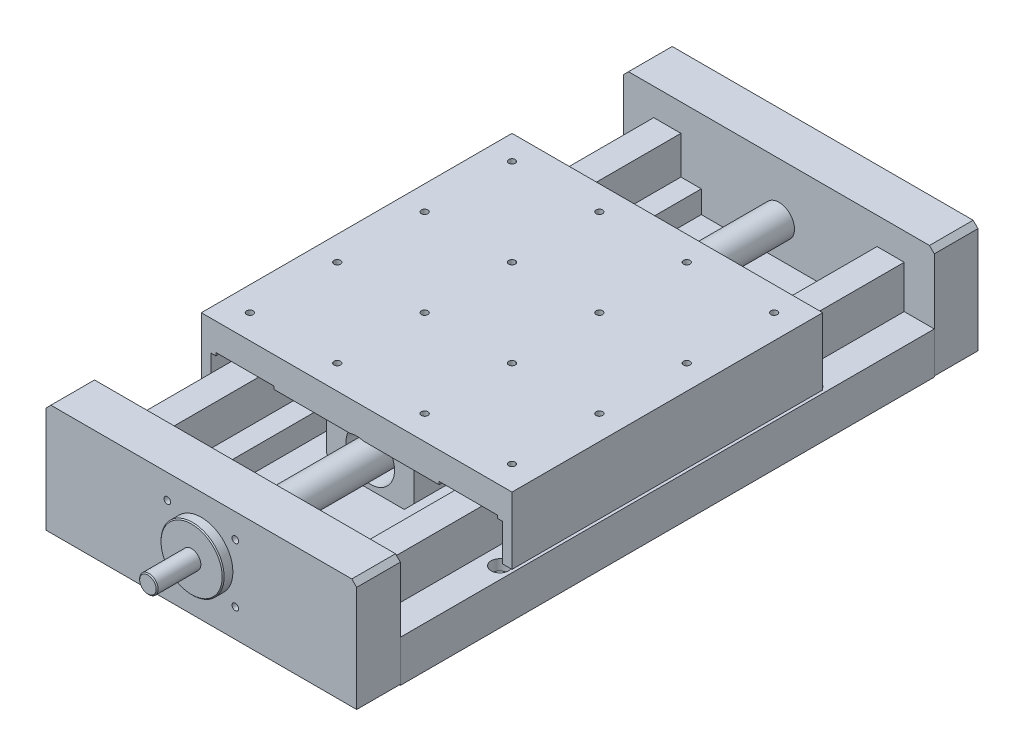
from build123d import *

# Parameters (mm, degrees)
EXTRUDE_1_DEPTH              = 550
SKETCH_2_W                   = 180
SKETCH_2_H                   = 1
CUT_EXTRUDE_1_DEPTH          = 574.345445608
SKETCH_3_W                   = 28
SKETCH_3_H                   = 550
EXTRUDE_2_DEPTH              = 42
EXTRUDE_2_2_DEPTH            = 42
EXTRUDE_3_DEPTH              = 160
SKETCH_5_W                   = 90
SKETCH_5_H                   = 57
SKETCH_5_R                   = 17.5
EXTRUDE_4_DEPTH              = 150
CHAMFER_1_SIZE               = 10
SKETCH_6_R                   = 25
CUT_EXTRUDE_2_DEPTH          = 90
SKETCH_7_W                   = 92.691152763
SKETCH_7_H                   = 55.470337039
CUT_EXTRUDE_3_DEPTH          = 14
SKETCH_8_W                   = 320
SKETCH_8_H                   = 114
EXTRUDE_5_DEPTH              = 45
SKETCH_9_W                   = 320
SKETCH_9_H                   = 114
EXTRUDE_6_DEPTH              = 45
SKETCH_10_R                  = 16
EXTRUDE_7_DEPTH              = 595
SKETCH_11_R                  = 9.5
EXTRUDE_8_DEPTH              = 55
SKETCH_12_R                  = 32.5
EXTRUDE_9_DEPTH              = 10
PATTERN_LINEAR_1_COUNT       = 3
PATTERN_LINEAR_1_PITCH       = 160
PATTERN_LINEAR_2_COUNT       = 2
PATTERN_LINEAR_2_PITCH       = 295
HOLE_WIZARD_M8_1_AT_2_COUNT  = 2
HOLE_WIZARD_M8_1_AT_2_PITCH  = 90
HOLE_WIZARD_M8_1_AT_3_COUNT  = 2
HOLE_WIZARD_M8_1_AT_3_PITCH  = 127.279220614
HOLE_WIZARD_M8_1_AT_4_COUNT  = 2
HOLE_WIZARD_M8_1_AT_4_PITCH  = 90
HOLE_WIZARD_M8_1_AT_5_COUNT  = 2
HOLE_WIZARD_M8_1_AT_5_PITCH  = 180
HOLE_WIZARD_M8_1_AT_6_COUNT  = 2
HOLE_WIZARD_M8_1_AT_6_PITCH  = 201.246117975
HOLE_WIZARD_M8_1_AT_7_COUNT  = 2
HOLE_WIZARD_M8_1_AT_7_PITCH  = 284.604989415
HOLE_WIZARD_M8_1_AT_8_COUNT  = 2
HOLE_WIZARD_M8_1_AT_8_PITCH  = 270
HOLE_WIZARD_M8_1_AT_9_COUNT  = 2
HOLE_WIZARD_M8_1_AT_9_PITCH  = 324.499614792
HOLE_WIZARD_M8_1_AT_10_COUNT = 2
HOLE_WIZARD_M8_1_AT_10_PITCH = 381.837661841
HOLE_WIZARD_M8_1_AT_11_COUNT = 2
HOLE_WIZARD_M8_1_AT_11_PITCH = 324.499614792
HOLE_WIZARD_M8_1_AT_12_COUNT = 2
HOLE_WIZARD_M8_1_AT_12_PITCH = 254.558441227
HOLE_WIZARD_M8_1_AT_13_COUNT = 2
HOLE_WIZARD_M8_1_AT_13_PITCH = 201.246117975
HOLE_WIZARD_M8_1_AT_14_COUNT = 2
HOLE_WIZARD_M8_1_AT_14_PITCH = 284.604989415
HOLE_WIZARD_M8_1_AT_15_COUNT = 2
HOLE_WIZARD_M8_1_AT_15_PITCH = 180
HOLE_WIZARD_M8_1_AT_16_COUNT = 2
HOLE_WIZARD_M8_1_AT_16_PITCH = 270
CHAMFER_2_SIZE               = 5
CHAMFER_3_SIZE               = 5
HOLE_WIZARD_M8_2_AT_2_COUNT  = 2
HOLE_WIZARD_M8_2_AT_2_PITCH  = 60
HOLE_WIZARD_M8_2_AT_3_COUNT  = 2
HOLE_WIZARD_M8_2_AT_3_PITCH  = 92.195444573
HOLE_WIZARD_M8_2_AT_4_COUNT  = 2
HOLE_WIZARD_M8_2_AT_4_PITCH  = 70
CHAMFER_4_SIZE               = 1


with BuildPart() as part:
    # Sketch 1 → Extrude 1 (new body)
    with BuildSketch(Plane.XY):
        Polygon((80, 0), (-80, 0), (-80, 23), (-101, 23), (-101, 20), (-129, 20), (-129, 18), (-160, 18), (-160, -25), (160, -25), (160, 18), (129, 18), (129, 20), (101, 20), (101, 23), (80, 23), align=None)
    extrude(amount=EXTRUDE_1_DEPTH)

    # Sketch 2 → Cut-Extrude 1 (cut, through all)
    with BuildSketch(Plane.XY.offset(550)):
        with Locations((0, -24.5)):
            Rectangle(SKETCH_2_W, SKETCH_2_H)
    extrude(amount=-CUT_EXTRUDE_1_DEPTH, mode=Mode.SUBTRACT)



with BuildPart() as body_2:
    # Sketch 3 → Extrude 2 (new body)
    with BuildSketch(Plane(origin=(0, 20, 0), x_dir=(1, 0, 0), z_dir=(0, 1, 0))):
        with Locations((-115, -275)):
            Rectangle(SKETCH_3_W, SKETCH_3_H)
    extrude(amount=EXTRUDE_2_DEPTH)


with BuildPart() as body_3:
    # Sketch 3 → Extrude 2 2 (new body)
    with BuildSketch(Plane(origin=(0, 20, 0), x_dir=(1, 0, 0), z_dir=(0, 1, 0))):
        with Locations((115, -275)):
            Rectangle(SKETCH_3_W, SKETCH_3_H)
    extrude(amount=EXTRUDE_2_2_DEPTH)


with BuildPart() as part_1:
    add(part.part)

    add(body_3.part)  # Extrude 3 merges body 3

    add(body_2.part)  # Extrude 3 merges body 2
    # Sketch 4 → Extrude 3 (add, symmetric)
    with BuildSketch(Plane.XY.offset(275)):
        Polygon((-115, 62), (-85, 62), (-85, 59), (-45, 59), (-45, 62), (45, 62), (45, 59), (85, 59), (85, 62), (115, 62), (145, 62), (145, 59), (150, 59), (150, 21), (160, 21), (160, 90), (-160, 90), (-160, 21), (-150, 21), (-150, 59), (-145, 59), (-145, 62), align=None)
    extrude(amount=EXTRUDE_3_DEPTH, both=True)

    # Sketch 5 → Extrude 4 (add)
    with BuildSketch(Plane.XY.offset(435)):
        with Locations((0, 33.5)):
            Rectangle(SKETCH_5_W, SKETCH_5_H)
        with Locations((0, 35)):
            Circle(SKETCH_5_R, mode=Mode.SUBTRACT)
    extrude(amount=-EXTRUDE_4_DEPTH)

    # Chamfer 1
    chamfer_1_edges = [part_1.edges().sort_by_distance(p)[0] for p in [
        (-45, 5, 360),
        (45, 5, 360),
    ]]
    chamfer(chamfer_1_edges, length=CHAMFER_1_SIZE)

    # Sketch 6 → Cut-Extrude 2 (cut)
    with BuildSketch(Plane.XY.offset(435)):
        with Locations((0, 35)):
            Circle(SKETCH_6_R)
    extrude(amount=-CUT_EXTRUDE_2_DEPTH, mode=Mode.SUBTRACT)

    # Sketch 7 → Cut-Extrude 3 (cut)
    with BuildSketch(Plane.XY.offset(435)):
        with Locations((1.345576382, 31.264831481)):
            Rectangle(SKETCH_7_W, SKETCH_7_H)
    extrude(amount=-CUT_EXTRUDE_3_DEPTH, mode=Mode.SUBTRACT)

    # Sketch 14 → Hole Wizard 1 (revolve, cut)
    with BuildSketch(Plane(origin=(-147.5, 18, 115), x_dir=(0, 0, 1), z_dir=(1, 0, 0))):
        Polygon((0, 0), (0, 43), (5.5, 43), (5.5, 11), (9, 11), (9, 0), align=None)
    hole_wizard_1 = revolve(axis=Axis((-147.5, 24.35, 115), (0, -1, 0)), mode=Mode.SUBTRACT)

    # Pattern Linear 1: Hole Wizard 1 ×3
    with Locations(*[(0, 0, i * PATTERN_LINEAR_1_PITCH) for i in range(1, PATTERN_LINEAR_1_COUNT)]):
        add(hole_wizard_1, mode=Mode.SUBTRACT)

    # Pattern Linear 2: Hole Wizard 1 ×2
    with Locations(*[(i * PATTERN_LINEAR_2_PITCH, 0, 0) for i in range(1, PATTERN_LINEAR_2_COUNT)]):
        add(hole_wizard_1, mode=Mode.SUBTRACT)

    # Pattern Linear 2 copy 1 sketch → Pattern Linear 2 copy 1 (revolve, cut)
    with BuildSketch(Plane(origin=(147.5, 18, 275), x_dir=(0, 0, 1), z_dir=(1, 0, 0))):
        Polygon((0, 0), (0, 43), (5.5, 43), (5.5, 11), (9, 11), (9, 0), align=None)
    revolve(axis=Axis((147.5, 24.35, 275), (0, -1, 0)), mode=Mode.SUBTRACT)

    # Pattern Linear 2 copy 2 sketch → Pattern Linear 2 copy 2 (revolve, cut)
    with BuildSketch(Plane(origin=(147.5, 18, 435), x_dir=(0, 0, 1), z_dir=(1, 0, 0))):
        Polygon((0, 0), (0, 43), (5.5, 43), (5.5, 11), (9, 11), (9, 0), align=None)
    revolve(axis=Axis((147.5, 24.35, 435), (0, -1, 0)), mode=Mode.SUBTRACT)

    # Sketch 35 → Hole Wizard M8 _1 (revolve, cut)
    with BuildSketch(Plane(origin=(-135, 90, 140), x_dir=(0, 0, 1), z_dir=(1, 0, 0))):
        Polygon((0, 0), (0, 21.792926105), (3.4, 19.75), (3.4, 0), align=None)
    hole_wizard_m8_1 = revolve(axis=Axis((-135, 96.35, 140), (0, -1, 0)), mode=Mode.SUBTRACT)

    # Hole Wizard M8 _1 at 2: Hole Wizard M8 _1 ×2
    with Locations(*[(0, 0, i * HOLE_WIZARD_M8_1_AT_2_PITCH) for i in range(1, HOLE_WIZARD_M8_1_AT_2_COUNT)]):
        add(hole_wizard_m8_1, mode=Mode.SUBTRACT)

    # Hole Wizard M8 _1 at 3: Hole Wizard M8 _1 ×2
    with Locations(*[Vector(0.7071067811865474, 0, 0.7071067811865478) * (i * HOLE_WIZARD_M8_1_AT_3_PITCH) for i in range(1, HOLE_WIZARD_M8_1_AT_3_COUNT)]):
        add(hole_wizard_m8_1, mode=Mode.SUBTRACT)

    # Hole Wizard M8 _1 at 4: Hole Wizard M8 _1 ×2
    with Locations(*[(i * HOLE_WIZARD_M8_1_AT_4_PITCH, 0, 0) for i in range(1, HOLE_WIZARD_M8_1_AT_4_COUNT)]):
        add(hole_wizard_m8_1, mode=Mode.SUBTRACT)

    # Hole Wizard M8 _1 at 5: Hole Wizard M8 _1 ×2
    with Locations(*[(i * HOLE_WIZARD_M8_1_AT_5_PITCH, 0, 0) for i in range(1, HOLE_WIZARD_M8_1_AT_5_COUNT)]):
        add(hole_wizard_m8_1, mode=Mode.SUBTRACT)

    # Hole Wizard M8 _1 at 6: Hole Wizard M8 _1 ×2
    with Locations(*[Vector(0.8944271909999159, 0, 0.44721359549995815) * (i * HOLE_WIZARD_M8_1_AT_6_PITCH) for i in range(1, HOLE_WIZARD_M8_1_AT_6_COUNT)]):
        add(hole_wizard_m8_1, mode=Mode.SUBTRACT)

    # Hole Wizard M8 _1 at 7: Hole Wizard M8 _1 ×2
    with Locations(*[Vector(0.9486832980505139, 0, 0.316227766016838) * (i * HOLE_WIZARD_M8_1_AT_7_PITCH) for i in range(1, HOLE_WIZARD_M8_1_AT_7_COUNT)]):
        add(hole_wizard_m8_1, mode=Mode.SUBTRACT)

    # Hole Wizard M8 _1 at 8: Hole Wizard M8 _1 ×2
    with Locations(*[(i * HOLE_WIZARD_M8_1_AT_8_PITCH, 0, 0) for i in range(1, HOLE_WIZARD_M8_1_AT_8_COUNT)]):
        add(hole_wizard_m8_1, mode=Mode.SUBTRACT)

    # Hole Wizard M8 _1 at 9: Hole Wizard M8 _1 ×2
    with Locations(*[Vector(0.8320502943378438, 0, 0.554700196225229) * (i * HOLE_WIZARD_M8_1_AT_9_PITCH) for i in range(1, HOLE_WIZARD_M8_1_AT_9_COUNT)]):
        add(hole_wizard_m8_1, mode=Mode.SUBTRACT)

    # Hole Wizard M8 _1 at 10: Hole Wizard M8 _1 ×2
    with Locations(*[Vector(0.7071067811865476, 0, 0.7071067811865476) * (i * HOLE_WIZARD_M8_1_AT_10_PITCH) for i in range(1, HOLE_WIZARD_M8_1_AT_10_COUNT)]):
        add(hole_wizard_m8_1, mode=Mode.SUBTRACT)

    # Hole Wizard M8 _1 at 11: Hole Wizard M8 _1 ×2
    with Locations(*[Vector(0.5547001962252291, 0, 0.8320502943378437) * (i * HOLE_WIZARD_M8_1_AT_11_PITCH) for i in range(1, HOLE_WIZARD_M8_1_AT_11_COUNT)]):
        add(hole_wizard_m8_1, mode=Mode.SUBTRACT)

    # Hole Wizard M8 _1 at 12: Hole Wizard M8 _1 ×2
    with Locations(*[Vector(0.7071067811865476, 0, 0.7071067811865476) * (i * HOLE_WIZARD_M8_1_AT_12_PITCH) for i in range(1, HOLE_WIZARD_M8_1_AT_12_COUNT)]):
        add(hole_wizard_m8_1, mode=Mode.SUBTRACT)

    # Hole Wizard M8 _1 at 13: Hole Wizard M8 _1 ×2
    with Locations(*[Vector(0.44721359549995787, 0, 0.894427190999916) * (i * HOLE_WIZARD_M8_1_AT_13_PITCH) for i in range(1, HOLE_WIZARD_M8_1_AT_13_COUNT)]):
        add(hole_wizard_m8_1, mode=Mode.SUBTRACT)

    # Hole Wizard M8 _1 at 14: Hole Wizard M8 _1 ×2
    with Locations(*[Vector(0.31622776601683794, 0, 0.9486832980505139) * (i * HOLE_WIZARD_M8_1_AT_14_PITCH) for i in range(1, HOLE_WIZARD_M8_1_AT_14_COUNT)]):
        add(hole_wizard_m8_1, mode=Mode.SUBTRACT)

    # Hole Wizard M8 _1 at 15: Hole Wizard M8 _1 ×2
    with Locations(*[(0, 0, i * HOLE_WIZARD_M8_1_AT_15_PITCH) for i in range(1, HOLE_WIZARD_M8_1_AT_15_COUNT)]):
        add(hole_wizard_m8_1, mode=Mode.SUBTRACT)

    # Hole Wizard M8 _1 at 16: Hole Wizard M8 _1 ×2
    with Locations(*[(0, 0, i * HOLE_WIZARD_M8_1_AT_16_PITCH) for i in range(1, HOLE_WIZARD_M8_1_AT_16_COUNT)]):
        add(hole_wizard_m8_1, mode=Mode.SUBTRACT)


with BuildPart() as body_2_2:
    # Sketch 8 → Extrude 5 (new body)
    with BuildSketch(Plane.XY.offset(550)):
        with Locations((0, 33)):
            Rectangle(SKETCH_8_W, SKETCH_8_H)
    extrude(amount=EXTRUDE_5_DEPTH)



with BuildPart() as body_3_2:
    # Sketch 9 → Extrude 6 (new body)
    with BuildSketch(Plane(origin=(0, 0, 0), x_dir=(-1, 0, 0), z_dir=(0, 0, -1))):
        with Locations((0, 33)):
            Rectangle(SKETCH_9_W, SKETCH_9_H)
    extrude(amount=EXTRUDE_6_DEPTH)

    # Chamfer 3
    chamfer_3_edges = [body_3_2.edges().sort_by_distance(p)[0] for p in [
        (160, 90, -22.5),
        (-160, 90, -22.5),
    ]]
    chamfer(chamfer_3_edges, length=CHAMFER_3_SIZE)


with BuildPart() as body_4:
    # Sketch 10 → Extrude 7 (new body)
    with BuildSketch(Plane.XY):
        with Locations((0, 35)):
            Circle(SKETCH_10_R)
    extrude(amount=EXTRUDE_7_DEPTH)


with BuildPart() as body_2_2_1:
    add(body_2_2.part)

    add(body_4.part)  # Extrude 8 merges body 4
    # Sketch 11 → Extrude 8 (add)
    with BuildSketch(Plane.XY.offset(595)):
        with Locations((0, 35)):
            Circle(SKETCH_11_R)
    extrude(amount=EXTRUDE_8_DEPTH)

    # Sketch 12 → Extrude 9 (add)
    with BuildSketch(Plane.XY.offset(595)):
        with Locations((0, 35)):
            Circle(SKETCH_12_R)
    extrude(amount=EXTRUDE_9_DEPTH)

    # Chamfer 2
    chamfer_2_edges = [body_2_2_1.edges().sort_by_distance(p)[0] for p in [
        (-160, 90, 572.5),
        (160, 90, 572.5),
    ]]
    chamfer(chamfer_2_edges, length=CHAMFER_2_SIZE)

    # Sketch 37 → Hole Wizard M8 _2 (revolve, cut)
    with BuildSketch(Plane(origin=(-35, 65, 595), x_dir=(0, -1, 0), z_dir=(1, 0, 0))):
        Polygon((0, 0), (0, 21.792926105), (3.4, 19.75), (3.4, 0), align=None)
    hole_wizard_m8_2 = revolve(axis=Axis((-35, 65, 601.35), (0, 0, -1)), mode=Mode.SUBTRACT)

    # Hole Wizard M8 _2 at 2: Hole Wizard M8 _2 ×2
    with Locations(*[(0, -i * HOLE_WIZARD_M8_2_AT_2_PITCH, 0) for i in range(1, HOLE_WIZARD_M8_2_AT_2_COUNT)]):
        add(hole_wizard_m8_2, mode=Mode.SUBTRACT)

    # Hole Wizard M8 _2 at 3: Hole Wizard M8 _2 ×2
    with Locations(*[Vector(0.7592566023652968, -0.6507913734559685, 0) * (i * HOLE_WIZARD_M8_2_AT_3_PITCH) for i in range(1, HOLE_WIZARD_M8_2_AT_3_COUNT)]):
        add(hole_wizard_m8_2, mode=Mode.SUBTRACT)

    # Hole Wizard M8 _2 at 4: Hole Wizard M8 _2 ×2
    with Locations(*[(i * HOLE_WIZARD_M8_2_AT_4_PITCH, 0, 0) for i in range(1, HOLE_WIZARD_M8_2_AT_4_COUNT)]):
        add(hole_wizard_m8_2, mode=Mode.SUBTRACT)

    # Chamfer 4
    chamfer_4_edges = [body_2_2_1.edges().sort_by_distance(p)[0] for p in [
        (-9.5, 35, 650),
        (-32.5, 35, 605),
    ]]
    chamfer(chamfer_4_edges, length=CHAMFER_4_SIZE)


solid = Compound([part_1.part, body_3_2.part, body_2_2_1.part])
